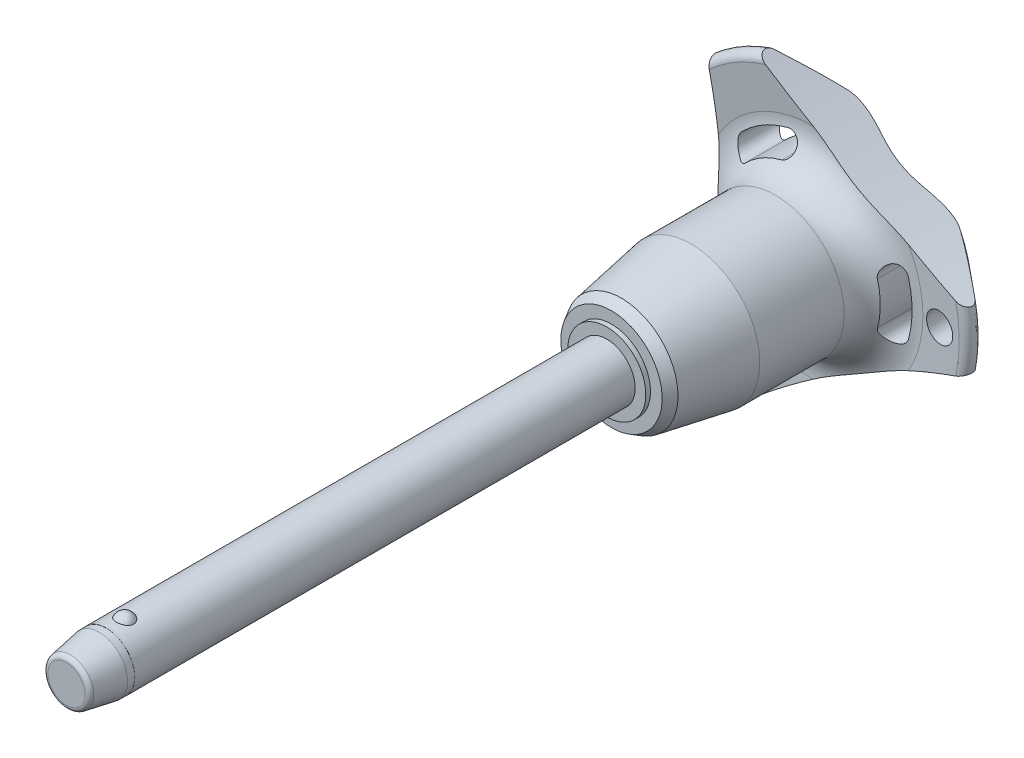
from build123d import *

# Parameters (mm, degrees)
SKETCH1_R           = 3
BOSS_EXTRUDE1_DEPTH = 50
SKETCH2_R           = 2.5
BOSS_EXTRUDE2_DEPTH = 26.7
BOSS_EXTRUDE3_START = 7
SKETCH1_2_R         = 3
BOSS_EXTRUDE3_DEPTH = 7
CHAMFER1_SIZE       = 3.5
CHAMFER1_SIZE2      = 0.617144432
FILLET1_R           = 0.5
SKETCH6_R           = 79.96
CUT_EXTRUDE1_DEPTH  = 81.212991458
CIRPATTERN1_COUNT   = 3
SKETCH7_R           = 1.5
CUT_EXTRUDE2_DEPTH  = 81.023009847
SKETCH8_R           = 3
SKETCH8_R_2         = 2.99
CUT_EXTRUDE3_DEPTH  = 4.2


with BuildPart() as part:
    # Sketch1 → Boss-Extrude1 (new body)
    with BuildSketch(Plane.XY):
        Circle(SKETCH1_R)
    extrude(amount=-BOSS_EXTRUDE1_DEPTH)

    # Sketch2 → Boss-Extrude2 (add)
    with BuildSketch(Plane(origin=(0, 0, -50), x_dir=(-1, 0, 0), z_dir=(0, 0, -1))):
        Circle(SKETCH2_R)
    extrude(amount=BOSS_EXTRUDE2_DEPTH)

    # Sketch3 → Revolve1 (revolve)
    with BuildSketch(Plane(origin=(0, 0, 0), x_dir=(0, 0, -1), z_dir=(1, 0, 0))):
        with BuildLine():
            Line((-0.866025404, 3.5), (-0.866025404, 1.5))
            ThreePointArc((-0.866025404, 1.5), (0.133974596, 2.5), (-0.866025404, 3.5))
        make_face()
        with BuildLine():
            Line((-0.866025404, -1.5), (-0.866025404, -3.5))
            ThreePointArc((-0.866025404, -3.5), (0.133974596, -2.5), (-0.866025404, -1.5))
        make_face()
    revolve(axis=Axis((0, -1.5, 0.866025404), (0, 1, 0)))

    # Sketch1_2 → Boss-Extrude3 (add)
    with BuildSketch(Plane.XY.offset(BOSS_EXTRUDE3_START)):
        Circle(SKETCH1_2_R)
    extrude(amount=-BOSS_EXTRUDE3_DEPTH)

    # Chamfer1
    chamfer1_edges = [part.edges().sort_by_distance(p)[0] for p in [
        (-3, 0, 7),
    ]]
    chamfer1_side = [part.faces().sort_by_distance(p)[0] for p in [
        (-3, 0, -21.5),
    ]]
    chamfer(chamfer1_edges, length=CHAMFER1_SIZE, length2=CHAMFER1_SIZE2, reference=chamfer1_side[0])

    # Fillet1
    fillet1_edges = [part.edges().sort_by_distance(p)[0] for p in [
        (-2.382855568, 0, 7),
        (2.5, 0, -76.7),
    ]]
    fillet(fillet1_edges, radius=FILLET1_R)

    # Sketch4 → Revolve2 (revolve)
    with BuildSketch(Plane(origin=(0, 0, 0), x_dir=(0, 0, -1), z_dir=(1, 0, 0)), mode=Mode.PRIVATE) as revolve2_sk:
        Polygon((50, 0), (50, 4.118359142), (50.5, 4.118359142), (50.5, 5.343400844), (51.560917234, 5.955921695), (58.9, 7.25), (67.8, 7.25), (67.8, 0), align=None)
    revolve(revolve2_sk.sketch.rotate(Axis((0, 0, -67.8), (0, 0, 1)), 90), axis=Axis((0, 0, -67.8), (0, 0, 1)))

    # Sketch5 → Revolve3 (revolve)
    with BuildSketch(Plane(origin=(0, 0, 0), x_dir=(0, 0, -1), z_dir=(1, 0, 0)), mode=Mode.PRIVATE) as revolve3_sk:
        with BuildLine():
            Line((71.78715932, 11.570250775), (71.452568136, 15.735949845))
            ThreePointArc((71.452568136, 15.735949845), (71.946485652, 16.540188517), (72.862835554, 16.314230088))
            Line((72.862835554, 16.314230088), (76.326414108, 12.186497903))
            ThreePointArc((76.326414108, 12.186497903), (76.7, 11.109282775), (76.261488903, 10.056825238))
            ThreePointArc((76.261488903, 10.056825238), (73.289873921, 5.413681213), (72.25, 0))
            Line((72.25, 0), (67.8, 0))
            Line((67.8, 0), (67.8, 7.25))
            ThreePointArc((67.8, 7.25), (70.739473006, 8.537160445), (71.78715932, 11.570250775))
        make_face()
    revolve(revolve3_sk.sketch.rotate(Axis((0, 0, -72.25), (0, 0, 1)), 90), axis=Axis((0, 0, -72.25), (0, 0, 1)))

    # Sketch6 → Cut-Extrude1 (cut, through all)
    with BuildSketch(Plane.XY):
        with Locations((-89.76, 0)):
            Circle(SKETCH6_R)
        with BuildLine():
            ThreePointArc((10.099921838, -2.834717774), (10.490188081, 0), (10.099921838, 2.834717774))
            ThreePointArc((10.099921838, 2.834717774), (8.768180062, 3.582738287), (8.020159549, 2.250996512))
            ThreePointArc((8.020159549, 2.250996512), (8.330062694, 0), (8.020159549, -2.250996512))
            ThreePointArc((8.020159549, -2.250996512), (8.768180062, -3.582738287), (10.099921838, -2.834717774))
        make_face()
    cut_extrude1 = extrude(amount=-CUT_EXTRUDE1_DEPTH, mode=Mode.SUBTRACT)

    # CirPattern1: Cut-Extrude1 ×3 about axis
    cirpattern1_axis = Axis((0, 0, 0), (0, 0, 1))
    for i in range(1, CIRPATTERN1_COUNT):
        add(cut_extrude1.rotate(cirpattern1_axis, i * 360 / CIRPATTERN1_COUNT), mode=Mode.SUBTRACT)

    # Sketch7 → Cut-Extrude2 (cut, through all)
    with BuildSketch(Plane.XY):
        with Locations(Location((13.490188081, 0, 0), (0, 0, 225.221865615))):
            Circle(SKETCH7_R)
    extrude(amount=-CUT_EXTRUDE2_DEPTH, mode=Mode.SUBTRACT)

    # Sketch8 → Cut-Extrude3 (cut)
    with BuildSketch(Plane.XY.offset(7)):
        Circle(SKETCH8_R)
        Circle(SKETCH8_R_2, mode=Mode.SUBTRACT)
    extrude(amount=-CUT_EXTRUDE3_DEPTH, mode=Mode.SUBTRACT)


solid = part.part
